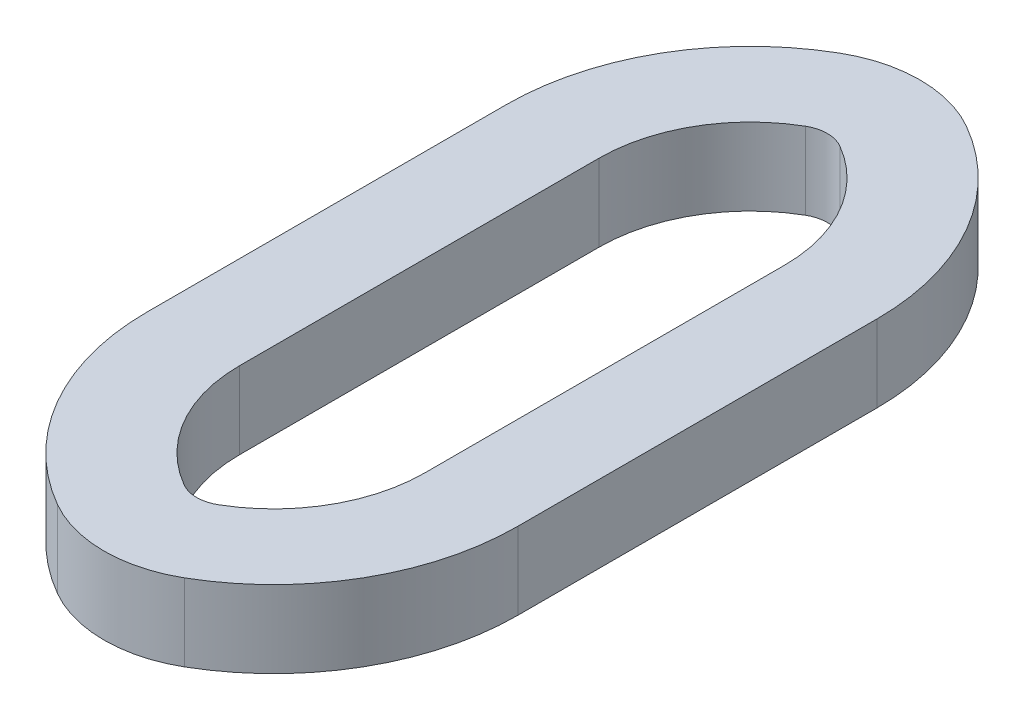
ISO-10303-21;
HEADER;
FILE_DESCRIPTION(('STEP AP214'),'2;1');
FILE_NAME('part.step','',(''),(''),'','','');
FILE_SCHEMA(('AUTOMOTIVE_DESIGN { 1 0 10303 214 1 1 1 1 }'));
ENDSEC;
DATA;
#1=APPLICATION_CONTEXT('core data for automotive mechanical design processes');
#2=APPLICATION_PROTOCOL_DEFINITION('international standard','automotive_design',2000,#1);
#3=PRODUCT_CONTEXT('',#1,'mechanical');
#4=PRODUCT('Part','Part','',(#3));
#5=PRODUCT_RELATED_PRODUCT_CATEGORY('part','',(#4));
#6=PRODUCT_DEFINITION_FORMATION('','',#4);
#7=PRODUCT_DEFINITION_CONTEXT('part definition',#1,'design');
#8=PRODUCT_DEFINITION('design','',#6,#7);
#9=PRODUCT_DEFINITION_SHAPE('','',#8);
#10=(LENGTH_UNIT() NAMED_UNIT(*) SI_UNIT(.MILLI.,.METRE.));
#11=(NAMED_UNIT(*) PLANE_ANGLE_UNIT() SI_UNIT($,.RADIAN.));
#12=(NAMED_UNIT(*) SI_UNIT($,.STERADIAN.) SOLID_ANGLE_UNIT());
#13=UNCERTAINTY_MEASURE_WITH_UNIT(LENGTH_MEASURE(1.E-05),#10,'distance_accuracy_value','');
#14=(GEOMETRIC_REPRESENTATION_CONTEXT(3) GLOBAL_UNCERTAINTY_ASSIGNED_CONTEXT((#13)) GLOBAL_UNIT_ASSIGNED_CONTEXT((#10,
#11,#12)) REPRESENTATION_CONTEXT('',''));
#15=CARTESIAN_POINT('',(0.,0.,0.));
#16=DIRECTION('',(0.,0.,1.));
#17=DIRECTION('',(1.,0.,0.));
#18=AXIS2_PLACEMENT_3D('',#15,#16,#17);
#19=CARTESIAN_POINT('',(-42.8,10.19,-3.92076951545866));
#20=DIRECTION('',(0.,1.,0.));
#21=DIRECTION('',(0.,0.,1.));
#22=AXIS2_PLACEMENT_3D('',#19,#20,#21);
#23=PLANE('',#22);
#24=CARTESIAN_POINT('',(-42.8,10.19,-3.92076951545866));
#25=DIRECTION('',(0.,1.,0.));
#26=DIRECTION('',(0.,0.,1.));
#27=AXIS2_PLACEMENT_3D('',#24,#25,#26);
#28=CIRCLE('',#27,2.50000000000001);
#29=CARTESIAN_POINT('',(-40.3,10.19,-3.92076951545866));
#30=VERTEX_POINT('',#29);
#31=CARTESIAN_POINT('',(-41.55,10.19,-6.08583302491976));
#32=VERTEX_POINT('',#31);
#33=EDGE_CURVE('E219',#30,#32,#28,.T.);
#34=ORIENTED_EDGE('',*,*,#33,.T.);
#35=CARTESIAN_POINT('',(-42.2,10.19,-4.96));
#36=DIRECTION('',(0.,1.,0.));
#37=DIRECTION('',(0.,0.,1.));
#38=AXIS2_PLACEMENT_3D('',#35,#36,#37);
#39=CIRCLE('',#38,1.3);
#40=CARTESIAN_POINT('',(-42.85,10.19,-6.08583302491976));
#41=VERTEX_POINT('',#40);
#42=EDGE_CURVE('E222',#32,#41,#39,.T.);
#43=ORIENTED_EDGE('',*,*,#42,.T.);
#44=CARTESIAN_POINT('',(-41.6,10.19,-3.92076951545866));
#45=DIRECTION('',(0.,1.,0.));
#46=DIRECTION('',(0.,0.,1.));
#47=AXIS2_PLACEMENT_3D('',#44,#45,#46);
#48=CIRCLE('',#47,2.50000000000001);
#49=CARTESIAN_POINT('',(-44.1,10.19,-3.92076951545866));
#50=VERTEX_POINT('',#49);
#51=EDGE_CURVE('E225',#41,#50,#48,.T.);
#52=ORIENTED_EDGE('',*,*,#51,.T.);
#53=DIRECTION('',(0.,0.,1.));
#54=VECTOR('',#53,1.);
#55=CARTESIAN_POINT('',(-44.1,10.19,-3.92076951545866));
#56=LINE('',#55,#54);
#57=CARTESIAN_POINT('',(-44.1,10.19,-0.239230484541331));
#58=VERTEX_POINT('',#57);
#59=EDGE_CURVE('E227',#50,#58,#56,.T.);
#60=ORIENTED_EDGE('',*,*,#59,.T.);
#61=CARTESIAN_POINT('',(-41.6,10.19,-0.239230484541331));
#62=DIRECTION('',(0.,1.,0.));
#63=DIRECTION('',(0.,0.,1.));
#64=AXIS2_PLACEMENT_3D('',#61,#62,#63);
#65=CIRCLE('',#64,2.50000000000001);
#66=CARTESIAN_POINT('',(-42.85,10.19,1.92583302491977));
#67=VERTEX_POINT('',#66);
#68=EDGE_CURVE('E229',#58,#67,#65,.T.);
#69=ORIENTED_EDGE('',*,*,#68,.T.);
#70=CARTESIAN_POINT('',(-42.2,10.19,0.800000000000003));
#71=DIRECTION('',(0.,1.,0.));
#72=DIRECTION('',(0.,0.,1.));
#73=AXIS2_PLACEMENT_3D('',#70,#71,#72);
#74=CIRCLE('',#73,1.3);
#75=CARTESIAN_POINT('',(-41.55,10.19,1.92583302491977));
#76=VERTEX_POINT('',#75);
#77=EDGE_CURVE('E231',#67,#76,#74,.T.);
#78=ORIENTED_EDGE('',*,*,#77,.T.);
#79=CARTESIAN_POINT('',(-42.8,10.19,-0.239230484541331));
#80=DIRECTION('',(0.,1.,0.));
#81=DIRECTION('',(0.,0.,1.));
#82=AXIS2_PLACEMENT_3D('',#79,#80,#81);
#83=CIRCLE('',#82,2.50000000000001);
#84=CARTESIAN_POINT('',(-40.3,10.19,-0.239230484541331));
#85=VERTEX_POINT('',#84);
#86=EDGE_CURVE('E233',#76,#85,#83,.T.);
#87=ORIENTED_EDGE('',*,*,#86,.T.);
#88=DIRECTION('',(0.,0.,-1.));
#89=VECTOR('',#88,1.);
#90=CARTESIAN_POINT('',(-40.3,10.19,-0.239230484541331));
#91=LINE('',#90,#89);
#92=EDGE_CURVE('E235',#85,#30,#91,.T.);
#93=ORIENTED_EDGE('',*,*,#92,.T.);
#94=EDGE_LOOP('',(#34,#43,#52,#60,#69,#78,#87,#93));
#95=FACE_BOUND('',#94,.T.);
#96=CARTESIAN_POINT('',(-42.2,10.19,-4.96));
#97=DIRECTION('',(0.,1.,0.));
#98=DIRECTION('',(0.,0.,1.));
#99=AXIS2_PLACEMENT_3D('',#96,#97,#98);
#100=CIRCLE('',#99,0.349999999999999);
#101=CARTESIAN_POINT('',(-42.025,10.19,-5.26310889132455));
#102=VERTEX_POINT('',#101);
#103=CARTESIAN_POINT('',(-42.375,10.19,-5.26310889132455));
#104=VERTEX_POINT('',#103);
#105=EDGE_CURVE('E162',#102,#104,#100,.T.);
#106=ORIENTED_EDGE('',*,*,#105,.F.);
#107=CARTESIAN_POINT('',(-42.8,10.19,-3.92076951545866));
#108=DIRECTION('',(0.,1.,0.));
#109=DIRECTION('',(0.,0.,1.));
#110=AXIS2_PLACEMENT_3D('',#107,#108,#109);
#111=CIRCLE('',#110,1.55000000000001);
#112=CARTESIAN_POINT('',(-41.25,10.19,-3.92076951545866));
#113=VERTEX_POINT('',#112);
#114=EDGE_CURVE('E154',#113,#102,#111,.T.);
#115=ORIENTED_EDGE('',*,*,#114,.F.);
#116=DIRECTION('',(0.,0.,-1.));
#117=VECTOR('',#116,1.);
#118=CARTESIAN_POINT('',(-41.25,10.19,-0.239230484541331));
#119=LINE('',#118,#117);
#120=CARTESIAN_POINT('',(-41.25,10.19,-0.239230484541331));
#121=VERTEX_POINT('',#120);
#122=EDGE_CURVE('E187',#121,#113,#119,.T.);
#123=ORIENTED_EDGE('',*,*,#122,.F.);
#124=CARTESIAN_POINT('',(-42.8,10.19,-0.239230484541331));
#125=DIRECTION('',(0.,1.,0.));
#126=DIRECTION('',(0.,0.,1.));
#127=AXIS2_PLACEMENT_3D('',#124,#125,#126);
#128=CIRCLE('',#127,1.55000000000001);
#129=CARTESIAN_POINT('',(-42.025,10.19,1.10310889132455));
#130=VERTEX_POINT('',#129);
#131=EDGE_CURVE('E185',#130,#121,#128,.T.);
#132=ORIENTED_EDGE('',*,*,#131,.F.);
#133=CARTESIAN_POINT('',(-42.2,10.19,0.800000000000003));
#134=DIRECTION('',(0.,1.,0.));
#135=DIRECTION('',(0.,0.,1.));
#136=AXIS2_PLACEMENT_3D('',#133,#134,#135);
#137=CIRCLE('',#136,0.349999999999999);
#138=CARTESIAN_POINT('',(-42.375,10.19,1.10310889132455));
#139=VERTEX_POINT('',#138);
#140=EDGE_CURVE('E183',#139,#130,#137,.T.);
#141=ORIENTED_EDGE('',*,*,#140,.F.);
#142=CARTESIAN_POINT('',(-41.6,10.19,-0.239230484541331));
#143=DIRECTION('',(0.,1.,0.));
#144=DIRECTION('',(0.,0.,1.));
#145=AXIS2_PLACEMENT_3D('',#142,#143,#144);
#146=CIRCLE('',#145,1.55000000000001);
#147=CARTESIAN_POINT('',(-43.15,10.19,-0.239230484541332));
#148=VERTEX_POINT('',#147);
#149=EDGE_CURVE('E181',#148,#139,#146,.T.);
#150=ORIENTED_EDGE('',*,*,#149,.F.);
#151=DIRECTION('',(0.,0.,1.));
#152=VECTOR('',#151,1.);
#153=CARTESIAN_POINT('',(-43.15,10.19,-3.92076951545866));
#154=LINE('',#153,#152);
#155=CARTESIAN_POINT('',(-43.15,10.19,-3.92076951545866));
#156=VERTEX_POINT('',#155);
#157=EDGE_CURVE('E177',#156,#148,#154,.T.);
#158=ORIENTED_EDGE('',*,*,#157,.F.);
#159=CARTESIAN_POINT('',(-41.6,10.19,-3.92076951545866));
#160=DIRECTION('',(0.,1.,0.));
#161=DIRECTION('',(0.,0.,1.));
#162=AXIS2_PLACEMENT_3D('',#159,#160,#161);
#163=CIRCLE('',#162,1.55000000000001);
#164=EDGE_CURVE('E175',#104,#156,#163,.T.);
#165=ORIENTED_EDGE('',*,*,#164,.F.);
#166=EDGE_LOOP('',(#106,#115,#123,#132,#141,#150,#158,#165));
#167=FACE_BOUND('',#166,.T.);
#168=ADVANCED_FACE('F41',(#95,#167),#23,.T.);
#169=CARTESIAN_POINT('',(-42.8,9.4,-3.92076951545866));
#170=DIRECTION('',(0.,1.,0.));
#171=DIRECTION('',(0.,0.,1.));
#172=AXIS2_PLACEMENT_3D('',#169,#170,#171);
#173=PLANE('',#172);
#174=CARTESIAN_POINT('',(-42.8,9.4,-3.92076951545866));
#175=DIRECTION('',(0.,1.,0.));
#176=DIRECTION('',(0.,0.,1.));
#177=AXIS2_PLACEMENT_3D('',#174,#175,#176);
#178=CIRCLE('',#177,2.50000000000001);
#179=CARTESIAN_POINT('',(-40.3,9.4,-3.92076951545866));
#180=VERTEX_POINT('',#179);
#181=CARTESIAN_POINT('',(-41.55,9.4,-6.08583302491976));
#182=VERTEX_POINT('',#181);
#183=EDGE_CURVE('E170',#180,#182,#178,.T.);
#184=ORIENTED_EDGE('',*,*,#183,.F.);
#185=DIRECTION('',(0.,0.,-1.));
#186=VECTOR('',#185,1.);
#187=CARTESIAN_POINT('',(-40.3,9.4,-0.239230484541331));
#188=LINE('',#187,#186);
#189=CARTESIAN_POINT('',(-40.3,9.4,-0.239230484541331));
#190=VERTEX_POINT('',#189);
#191=EDGE_CURVE('E223',#190,#180,#188,.T.);
#192=ORIENTED_EDGE('',*,*,#191,.F.);
#193=CARTESIAN_POINT('',(-42.8,9.4,-0.239230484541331));
#194=DIRECTION('',(0.,1.,0.));
#195=DIRECTION('',(0.,0.,1.));
#196=AXIS2_PLACEMENT_3D('',#193,#194,#195);
#197=CIRCLE('',#196,2.50000000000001);
#198=CARTESIAN_POINT('',(-41.55,9.4,1.92583302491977));
#199=VERTEX_POINT('',#198);
#200=EDGE_CURVE('E250',#199,#190,#197,.T.);
#201=ORIENTED_EDGE('',*,*,#200,.F.);
#202=CARTESIAN_POINT('',(-42.2,9.4,0.800000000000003));
#203=DIRECTION('',(0.,1.,0.));
#204=DIRECTION('',(0.,0.,1.));
#205=AXIS2_PLACEMENT_3D('',#202,#203,#204);
#206=CIRCLE('',#205,1.3);
#207=CARTESIAN_POINT('',(-42.85,9.4,1.92583302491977));
#208=VERTEX_POINT('',#207);
#209=EDGE_CURVE('E248',#208,#199,#206,.T.);
#210=ORIENTED_EDGE('',*,*,#209,.F.);
#211=CARTESIAN_POINT('',(-41.6,9.4,-0.239230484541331));
#212=DIRECTION('',(0.,1.,0.));
#213=DIRECTION('',(0.,0.,1.));
#214=AXIS2_PLACEMENT_3D('',#211,#212,#213);
#215=CIRCLE('',#214,2.50000000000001);
#216=CARTESIAN_POINT('',(-44.1,9.4,-0.239230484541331));
#217=VERTEX_POINT('',#216);
#218=EDGE_CURVE('E246',#217,#208,#215,.T.);
#219=ORIENTED_EDGE('',*,*,#218,.F.);
#220=DIRECTION('',(0.,0.,1.));
#221=VECTOR('',#220,1.);
#222=CARTESIAN_POINT('',(-44.1,9.4,-3.92076951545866));
#223=LINE('',#222,#221);
#224=CARTESIAN_POINT('',(-44.1,9.4,-3.92076951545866));
#225=VERTEX_POINT('',#224);
#226=EDGE_CURVE('E244',#225,#217,#223,.T.);
#227=ORIENTED_EDGE('',*,*,#226,.F.);
#228=CARTESIAN_POINT('',(-41.6,9.4,-3.92076951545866));
#229=DIRECTION('',(0.,1.,0.));
#230=DIRECTION('',(0.,0.,1.));
#231=AXIS2_PLACEMENT_3D('',#228,#229,#230);
#232=CIRCLE('',#231,2.50000000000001);
#233=CARTESIAN_POINT('',(-42.85,9.4,-6.08583302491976));
#234=VERTEX_POINT('',#233);
#235=EDGE_CURVE('E242',#234,#225,#232,.T.);
#236=ORIENTED_EDGE('',*,*,#235,.F.);
#237=CARTESIAN_POINT('',(-42.2,9.4,-4.96));
#238=DIRECTION('',(0.,1.,0.));
#239=DIRECTION('',(0.,0.,1.));
#240=AXIS2_PLACEMENT_3D('',#237,#238,#239);
#241=CIRCLE('',#240,1.3);
#242=EDGE_CURVE('E240',#182,#234,#241,.T.);
#243=ORIENTED_EDGE('',*,*,#242,.F.);
#244=EDGE_LOOP('',(#184,#192,#201,#210,#219,#227,#236,#243));
#245=FACE_BOUND('',#244,.T.);
#246=CARTESIAN_POINT('',(-42.8,9.4,-3.92076951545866));
#247=DIRECTION('',(0.,1.,0.));
#248=DIRECTION('',(0.,0.,1.));
#249=AXIS2_PLACEMENT_3D('',#246,#247,#248);
#250=CIRCLE('',#249,1.55000000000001);
#251=CARTESIAN_POINT('',(-41.25,9.4,-3.92076951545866));
#252=VERTEX_POINT('',#251);
#253=CARTESIAN_POINT('',(-42.025,9.4,-5.26310889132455));
#254=VERTEX_POINT('',#253);
#255=EDGE_CURVE('E64',#252,#254,#250,.T.);
#256=ORIENTED_EDGE('',*,*,#255,.T.);
#257=CARTESIAN_POINT('',(-42.2,9.4,-4.96));
#258=DIRECTION('',(0.,1.,0.));
#259=DIRECTION('',(0.,0.,1.));
#260=AXIS2_PLACEMENT_3D('',#257,#258,#259);
#261=CIRCLE('',#260,0.349999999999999);
#262=CARTESIAN_POINT('',(-42.375,9.4,-5.26310889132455));
#263=VERTEX_POINT('',#262);
#264=EDGE_CURVE('E169',#254,#263,#261,.T.);
#265=ORIENTED_EDGE('',*,*,#264,.T.);
#266=CARTESIAN_POINT('',(-41.6,9.4,-3.92076951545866));
#267=DIRECTION('',(0.,1.,0.));
#268=DIRECTION('',(0.,0.,1.));
#269=AXIS2_PLACEMENT_3D('',#266,#267,#268);
#270=CIRCLE('',#269,1.55000000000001);
#271=CARTESIAN_POINT('',(-43.15,9.4,-3.92076951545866));
#272=VERTEX_POINT('',#271);
#273=EDGE_CURVE('E191',#263,#272,#270,.T.);
#274=ORIENTED_EDGE('',*,*,#273,.T.);
#275=DIRECTION('',(0.,0.,1.));
#276=VECTOR('',#275,1.);
#277=CARTESIAN_POINT('',(-43.15,9.4,-3.92076951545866));
#278=LINE('',#277,#276);
#279=CARTESIAN_POINT('',(-43.15,9.4,-0.239230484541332));
#280=VERTEX_POINT('',#279);
#281=EDGE_CURVE('E194',#272,#280,#278,.T.);
#282=ORIENTED_EDGE('',*,*,#281,.T.);
#283=CARTESIAN_POINT('',(-41.6,9.4,-0.239230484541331));
#284=DIRECTION('',(0.,1.,0.));
#285=DIRECTION('',(0.,0.,1.));
#286=AXIS2_PLACEMENT_3D('',#283,#284,#285);
#287=CIRCLE('',#286,1.55000000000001);
#288=CARTESIAN_POINT('',(-42.375,9.4,1.10310889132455));
#289=VERTEX_POINT('',#288);
#290=EDGE_CURVE('E197',#280,#289,#287,.T.);
#291=ORIENTED_EDGE('',*,*,#290,.T.);
#292=CARTESIAN_POINT('',(-42.2,9.4,0.800000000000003));
#293=DIRECTION('',(0.,1.,0.));
#294=DIRECTION('',(0.,0.,1.));
#295=AXIS2_PLACEMENT_3D('',#292,#293,#294);
#296=CIRCLE('',#295,0.349999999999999);
#297=CARTESIAN_POINT('',(-42.025,9.4,1.10310889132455));
#298=VERTEX_POINT('',#297);
#299=EDGE_CURVE('E200',#289,#298,#296,.T.);
#300=ORIENTED_EDGE('',*,*,#299,.T.);
#301=CARTESIAN_POINT('',(-42.8,9.4,-0.239230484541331));
#302=DIRECTION('',(0.,1.,0.));
#303=DIRECTION('',(0.,0.,1.));
#304=AXIS2_PLACEMENT_3D('',#301,#302,#303);
#305=CIRCLE('',#304,1.55000000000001);
#306=CARTESIAN_POINT('',(-41.25,9.4,-0.239230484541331));
#307=VERTEX_POINT('',#306);
#308=EDGE_CURVE('E203',#298,#307,#305,.T.);
#309=ORIENTED_EDGE('',*,*,#308,.T.);
#310=DIRECTION('',(0.,0.,-1.));
#311=VECTOR('',#310,1.);
#312=CARTESIAN_POINT('',(-41.25,9.4,-0.239230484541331));
#313=LINE('',#312,#311);
#314=EDGE_CURVE('E163',#307,#252,#313,.T.);
#315=ORIENTED_EDGE('',*,*,#314,.T.);
#316=EDGE_LOOP('',(#256,#265,#274,#282,#291,#300,#309,#315));
#317=FACE_BOUND('',#316,.T.);
#318=ADVANCED_FACE('F280',(#245,#317),#173,.F.);
#319=CARTESIAN_POINT('',(-42.8,10.19,-3.92076951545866));
#320=DIRECTION('',(0.,-1.,0.));
#321=DIRECTION('',(0.,0.,-1.));
#322=AXIS2_PLACEMENT_3D('',#319,#320,#321);
#323=CYLINDRICAL_SURFACE('',#322,2.50000000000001);
#324=ORIENTED_EDGE('',*,*,#183,.T.);
#325=DIRECTION('',(0.,-1.,0.));
#326=VECTOR('',#325,1.);
#327=CARTESIAN_POINT('',(-41.55,10.19,-6.08583302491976));
#328=LINE('',#327,#326);
#329=EDGE_CURVE('E11',#32,#182,#328,.T.);
#330=ORIENTED_EDGE('',*,*,#329,.F.);
#331=ORIENTED_EDGE('',*,*,#33,.F.);
#332=DIRECTION('',(0.,-1.,0.));
#333=VECTOR('',#332,1.);
#334=CARTESIAN_POINT('',(-40.3,10.19,-3.92076951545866));
#335=LINE('',#334,#333);
#336=EDGE_CURVE('E237',#30,#180,#335,.T.);
#337=ORIENTED_EDGE('',*,*,#336,.T.);
#338=EDGE_LOOP('',(#324,#330,#331,#337));
#339=FACE_BOUND('',#338,.T.);
#340=ADVANCED_FACE('F43',(#339),#323,.T.);
#341=CARTESIAN_POINT('',(-42.2,10.19,-4.96));
#342=DIRECTION('',(0.,-1.,0.));
#343=DIRECTION('',(0.,0.,-1.));
#344=AXIS2_PLACEMENT_3D('',#341,#342,#343);
#345=CYLINDRICAL_SURFACE('',#344,1.3);
#346=ORIENTED_EDGE('',*,*,#242,.T.);
#347=DIRECTION('',(0.,-1.,0.));
#348=VECTOR('',#347,1.);
#349=CARTESIAN_POINT('',(-42.85,10.19,-6.08583302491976));
#350=LINE('',#349,#348);
#351=EDGE_CURVE('E49',#41,#234,#350,.T.);
#352=ORIENTED_EDGE('',*,*,#351,.F.);
#353=ORIENTED_EDGE('',*,*,#42,.F.);
#354=ORIENTED_EDGE('',*,*,#329,.T.);
#355=EDGE_LOOP('',(#346,#352,#353,#354));
#356=FACE_BOUND('',#355,.T.);
#357=ADVANCED_FACE('F297',(#356),#345,.T.);
#358=CARTESIAN_POINT('',(-41.6,10.19,-3.92076951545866));
#359=DIRECTION('',(0.,-1.,0.));
#360=DIRECTION('',(0.,0.,-1.));
#361=AXIS2_PLACEMENT_3D('',#358,#359,#360);
#362=CYLINDRICAL_SURFACE('',#361,2.50000000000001);
#363=ORIENTED_EDGE('',*,*,#235,.T.);
#364=DIRECTION('',(0.,-1.,0.));
#365=VECTOR('',#364,1.);
#366=CARTESIAN_POINT('',(-44.1,10.19,-3.92076951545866));
#367=LINE('',#366,#365);
#368=EDGE_CURVE('E267',#50,#225,#367,.T.);
#369=ORIENTED_EDGE('',*,*,#368,.F.);
#370=ORIENTED_EDGE('',*,*,#51,.F.);
#371=ORIENTED_EDGE('',*,*,#351,.T.);
#372=EDGE_LOOP('',(#363,#369,#370,#371));
#373=FACE_BOUND('',#372,.T.);
#374=ADVANCED_FACE('F274',(#373),#362,.T.);
#375=CARTESIAN_POINT('',(-44.1,10.19,-3.92076951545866));
#376=DIRECTION('',(1.,0.,0.));
#377=DIRECTION('',(0.,0.,-1.));
#378=AXIS2_PLACEMENT_3D('',#375,#376,#377);
#379=PLANE('',#378);
#380=ORIENTED_EDGE('',*,*,#226,.T.);
#381=DIRECTION('',(0.,-1.,0.));
#382=VECTOR('',#381,1.);
#383=CARTESIAN_POINT('',(-44.1,10.19,-0.239230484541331));
#384=LINE('',#383,#382);
#385=EDGE_CURVE('E264',#58,#217,#384,.T.);
#386=ORIENTED_EDGE('',*,*,#385,.F.);
#387=ORIENTED_EDGE('',*,*,#59,.F.);
#388=ORIENTED_EDGE('',*,*,#368,.T.);
#389=EDGE_LOOP('',(#380,#386,#387,#388));
#390=FACE_BOUND('',#389,.T.);
#391=ADVANCED_FACE('F286',(#390),#379,.F.);
#392=CARTESIAN_POINT('',(-41.6,10.19,-0.239230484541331));
#393=DIRECTION('',(0.,-1.,0.));
#394=DIRECTION('',(0.,0.,-1.));
#395=AXIS2_PLACEMENT_3D('',#392,#393,#394);
#396=CYLINDRICAL_SURFACE('',#395,2.50000000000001);
#397=ORIENTED_EDGE('',*,*,#218,.T.);
#398=DIRECTION('',(0.,-1.,0.));
#399=VECTOR('',#398,1.);
#400=CARTESIAN_POINT('',(-42.85,10.19,1.92583302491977));
#401=LINE('',#400,#399);
#402=EDGE_CURVE('E261',#67,#208,#401,.T.);
#403=ORIENTED_EDGE('',*,*,#402,.F.);
#404=ORIENTED_EDGE('',*,*,#68,.F.);
#405=ORIENTED_EDGE('',*,*,#385,.T.);
#406=EDGE_LOOP('',(#397,#403,#404,#405));
#407=FACE_BOUND('',#406,.T.);
#408=ADVANCED_FACE('F290',(#407),#396,.T.);
#409=CARTESIAN_POINT('',(-42.2,10.19,0.800000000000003));
#410=DIRECTION('',(0.,-1.,0.));
#411=DIRECTION('',(0.,0.,-1.));
#412=AXIS2_PLACEMENT_3D('',#409,#410,#411);
#413=CYLINDRICAL_SURFACE('',#412,1.3);
#414=ORIENTED_EDGE('',*,*,#209,.T.);
#415=DIRECTION('',(0.,-1.,0.));
#416=VECTOR('',#415,1.);
#417=CARTESIAN_POINT('',(-41.55,10.19,1.92583302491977));
#418=LINE('',#417,#416);
#419=EDGE_CURVE('E258',#76,#199,#418,.T.);
#420=ORIENTED_EDGE('',*,*,#419,.F.);
#421=ORIENTED_EDGE('',*,*,#77,.F.);
#422=ORIENTED_EDGE('',*,*,#402,.T.);
#423=EDGE_LOOP('',(#414,#420,#421,#422));
#424=FACE_BOUND('',#423,.T.);
#425=ADVANCED_FACE('F310',(#424),#413,.T.);
#426=CARTESIAN_POINT('',(-42.8,10.19,-0.239230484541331));
#427=DIRECTION('',(0.,-1.,0.));
#428=DIRECTION('',(0.,0.,-1.));
#429=AXIS2_PLACEMENT_3D('',#426,#427,#428);
#430=CYLINDRICAL_SURFACE('',#429,2.50000000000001);
#431=ORIENTED_EDGE('',*,*,#200,.T.);
#432=DIRECTION('',(0.,-1.,0.));
#433=VECTOR('',#432,1.);
#434=CARTESIAN_POINT('',(-40.3,10.19,-0.239230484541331));
#435=LINE('',#434,#433);
#436=EDGE_CURVE('E255',#85,#190,#435,.T.);
#437=ORIENTED_EDGE('',*,*,#436,.F.);
#438=ORIENTED_EDGE('',*,*,#86,.F.);
#439=ORIENTED_EDGE('',*,*,#419,.T.);
#440=EDGE_LOOP('',(#431,#437,#438,#439));
#441=FACE_BOUND('',#440,.T.);
#442=ADVANCED_FACE('F308',(#441),#430,.T.);
#443=CARTESIAN_POINT('',(-40.3,10.19,-0.239230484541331));
#444=DIRECTION('',(-1.,0.,0.));
#445=DIRECTION('',(0.,0.,1.));
#446=AXIS2_PLACEMENT_3D('',#443,#444,#445);
#447=PLANE('',#446);
#448=ORIENTED_EDGE('',*,*,#191,.T.);
#449=ORIENTED_EDGE('',*,*,#336,.F.);
#450=ORIENTED_EDGE('',*,*,#92,.F.);
#451=ORIENTED_EDGE('',*,*,#436,.T.);
#452=EDGE_LOOP('',(#448,#449,#450,#451));
#453=FACE_BOUND('',#452,.T.);
#454=ADVANCED_FACE('F303',(#453),#447,.F.);
#455=CARTESIAN_POINT('',(-42.8,10.19,-3.92076951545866));
#456=DIRECTION('',(0.,-1.,0.));
#457=DIRECTION('',(0.,0.,-1.));
#458=AXIS2_PLACEMENT_3D('',#455,#456,#457);
#459=CYLINDRICAL_SURFACE('',#458,1.55000000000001);
#460=ORIENTED_EDGE('',*,*,#255,.F.);
#461=DIRECTION('',(0.,-1.,0.));
#462=VECTOR('',#461,1.);
#463=CARTESIAN_POINT('',(-41.25,10.19,-3.92076951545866));
#464=LINE('',#463,#462);
#465=EDGE_CURVE('E158',#113,#252,#464,.T.);
#466=ORIENTED_EDGE('',*,*,#465,.F.);
#467=ORIENTED_EDGE('',*,*,#114,.T.);
#468=DIRECTION('',(0.,-1.,0.));
#469=VECTOR('',#468,1.);
#470=CARTESIAN_POINT('',(-42.025,10.19,-5.26310889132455));
#471=LINE('',#470,#469);
#472=EDGE_CURVE('E157',#102,#254,#471,.T.);
#473=ORIENTED_EDGE('',*,*,#472,.T.);
#474=EDGE_LOOP('',(#460,#466,#467,#473));
#475=FACE_BOUND('',#474,.T.);
#476=ADVANCED_FACE('F156',(#475),#459,.F.);
#477=CARTESIAN_POINT('',(-42.2,10.19,-4.96));
#478=DIRECTION('',(0.,-1.,0.));
#479=DIRECTION('',(0.,0.,-1.));
#480=AXIS2_PLACEMENT_3D('',#477,#478,#479);
#481=CYLINDRICAL_SURFACE('',#480,0.349999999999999);
#482=ORIENTED_EDGE('',*,*,#264,.F.);
#483=ORIENTED_EDGE('',*,*,#472,.F.);
#484=ORIENTED_EDGE('',*,*,#105,.T.);
#485=DIRECTION('',(0.,-1.,0.));
#486=VECTOR('',#485,1.);
#487=CARTESIAN_POINT('',(-42.375,10.19,-5.26310889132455));
#488=LINE('',#487,#486);
#489=EDGE_CURVE('E171',#104,#263,#488,.T.);
#490=ORIENTED_EDGE('',*,*,#489,.T.);
#491=EDGE_LOOP('',(#482,#483,#484,#490));
#492=FACE_BOUND('',#491,.T.);
#493=ADVANCED_FACE('F166',(#492),#481,.F.);
#494=CARTESIAN_POINT('',(-41.6,10.19,-3.92076951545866));
#495=DIRECTION('',(0.,-1.,0.));
#496=DIRECTION('',(0.,0.,-1.));
#497=AXIS2_PLACEMENT_3D('',#494,#495,#496);
#498=CYLINDRICAL_SURFACE('',#497,1.55000000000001);
#499=ORIENTED_EDGE('',*,*,#273,.F.);
#500=ORIENTED_EDGE('',*,*,#489,.F.);
#501=ORIENTED_EDGE('',*,*,#164,.T.);
#502=DIRECTION('',(0.,-1.,0.));
#503=VECTOR('',#502,1.);
#504=CARTESIAN_POINT('',(-43.15,10.19,-3.92076951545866));
#505=LINE('',#504,#503);
#506=EDGE_CURVE('E216',#156,#272,#505,.T.);
#507=ORIENTED_EDGE('',*,*,#506,.T.);
#508=EDGE_LOOP('',(#499,#500,#501,#507));
#509=FACE_BOUND('',#508,.T.);
#510=ADVANCED_FACE('F335',(#509),#498,.F.);
#511=CARTESIAN_POINT('',(-43.15,10.19,-3.92076951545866));
#512=DIRECTION('',(1.,0.,0.));
#513=DIRECTION('',(0.,0.,-1.));
#514=AXIS2_PLACEMENT_3D('',#511,#512,#513);
#515=PLANE('',#514);
#516=ORIENTED_EDGE('',*,*,#281,.F.);
#517=ORIENTED_EDGE('',*,*,#506,.F.);
#518=ORIENTED_EDGE('',*,*,#157,.T.);
#519=DIRECTION('',(0.,-1.,0.));
#520=VECTOR('',#519,1.);
#521=CARTESIAN_POINT('',(-43.15,10.19,-0.239230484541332));
#522=LINE('',#521,#520);
#523=EDGE_CURVE('E214',#148,#280,#522,.T.);
#524=ORIENTED_EDGE('',*,*,#523,.T.);
#525=EDGE_LOOP('',(#516,#517,#518,#524));
#526=FACE_BOUND('',#525,.T.);
#527=ADVANCED_FACE('F339',(#526),#515,.T.);
#528=CARTESIAN_POINT('',(-41.6,10.19,-0.239230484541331));
#529=DIRECTION('',(0.,-1.,0.));
#530=DIRECTION('',(0.,0.,-1.));
#531=AXIS2_PLACEMENT_3D('',#528,#529,#530);
#532=CYLINDRICAL_SURFACE('',#531,1.55000000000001);
#533=ORIENTED_EDGE('',*,*,#290,.F.);
#534=ORIENTED_EDGE('',*,*,#523,.F.);
#535=ORIENTED_EDGE('',*,*,#149,.T.);
#536=DIRECTION('',(0.,-1.,0.));
#537=VECTOR('',#536,1.);
#538=CARTESIAN_POINT('',(-42.375,10.19,1.10310889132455));
#539=LINE('',#538,#537);
#540=EDGE_CURVE('E212',#139,#289,#539,.T.);
#541=ORIENTED_EDGE('',*,*,#540,.T.);
#542=EDGE_LOOP('',(#533,#534,#535,#541));
#543=FACE_BOUND('',#542,.T.);
#544=ADVANCED_FACE('F345',(#543),#532,.F.);
#545=CARTESIAN_POINT('',(-42.2,10.19,0.800000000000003));
#546=DIRECTION('',(0.,-1.,0.));
#547=DIRECTION('',(0.,0.,-1.));
#548=AXIS2_PLACEMENT_3D('',#545,#546,#547);
#549=CYLINDRICAL_SURFACE('',#548,0.349999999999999);
#550=ORIENTED_EDGE('',*,*,#299,.F.);
#551=ORIENTED_EDGE('',*,*,#540,.F.);
#552=ORIENTED_EDGE('',*,*,#140,.T.);
#553=DIRECTION('',(0.,-1.,0.));
#554=VECTOR('',#553,1.);
#555=CARTESIAN_POINT('',(-42.025,10.19,1.10310889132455));
#556=LINE('',#555,#554);
#557=EDGE_CURVE('E210',#130,#298,#556,.T.);
#558=ORIENTED_EDGE('',*,*,#557,.T.);
#559=EDGE_LOOP('',(#550,#551,#552,#558));
#560=FACE_BOUND('',#559,.T.);
#561=ADVANCED_FACE('F349',(#560),#549,.F.);
#562=CARTESIAN_POINT('',(-42.8,10.19,-0.239230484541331));
#563=DIRECTION('',(0.,-1.,0.));
#564=DIRECTION('',(0.,0.,-1.));
#565=AXIS2_PLACEMENT_3D('',#562,#563,#564);
#566=CYLINDRICAL_SURFACE('',#565,1.55000000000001);
#567=ORIENTED_EDGE('',*,*,#308,.F.);
#568=ORIENTED_EDGE('',*,*,#557,.F.);
#569=ORIENTED_EDGE('',*,*,#131,.T.);
#570=DIRECTION('',(0.,-1.,0.));
#571=VECTOR('',#570,1.);
#572=CARTESIAN_POINT('',(-41.25,10.19,-0.239230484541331));
#573=LINE('',#572,#571);
#574=EDGE_CURVE('E56',#121,#307,#573,.T.);
#575=ORIENTED_EDGE('',*,*,#574,.T.);
#576=EDGE_LOOP('',(#567,#568,#569,#575));
#577=FACE_BOUND('',#576,.T.);
#578=ADVANCED_FACE('F353',(#577),#566,.F.);
#579=CARTESIAN_POINT('',(-41.25,10.19,-0.239230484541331));
#580=DIRECTION('',(-1.,0.,0.));
#581=DIRECTION('',(0.,0.,1.));
#582=AXIS2_PLACEMENT_3D('',#579,#580,#581);
#583=PLANE('',#582);
#584=ORIENTED_EDGE('',*,*,#314,.F.);
#585=ORIENTED_EDGE('',*,*,#574,.F.);
#586=ORIENTED_EDGE('',*,*,#122,.T.);
#587=ORIENTED_EDGE('',*,*,#465,.T.);
#588=EDGE_LOOP('',(#584,#585,#586,#587));
#589=FACE_BOUND('',#588,.T.);
#590=ADVANCED_FACE('F357',(#589),#583,.T.);
#591=CLOSED_SHELL('',(#168,#318,#340,#357,#374,#391,#408,#425,#442,#454,#476,#493,#510,#527,
#544,#561,#578,#590));
#592=MANIFOLD_SOLID_BREP('B2',#591);
#593=ADVANCED_BREP_SHAPE_REPRESENTATION('',(#18,#592),#14);
#594=SHAPE_DEFINITION_REPRESENTATION(#9,#593);
ENDSEC;
END-ISO-10303-21;
